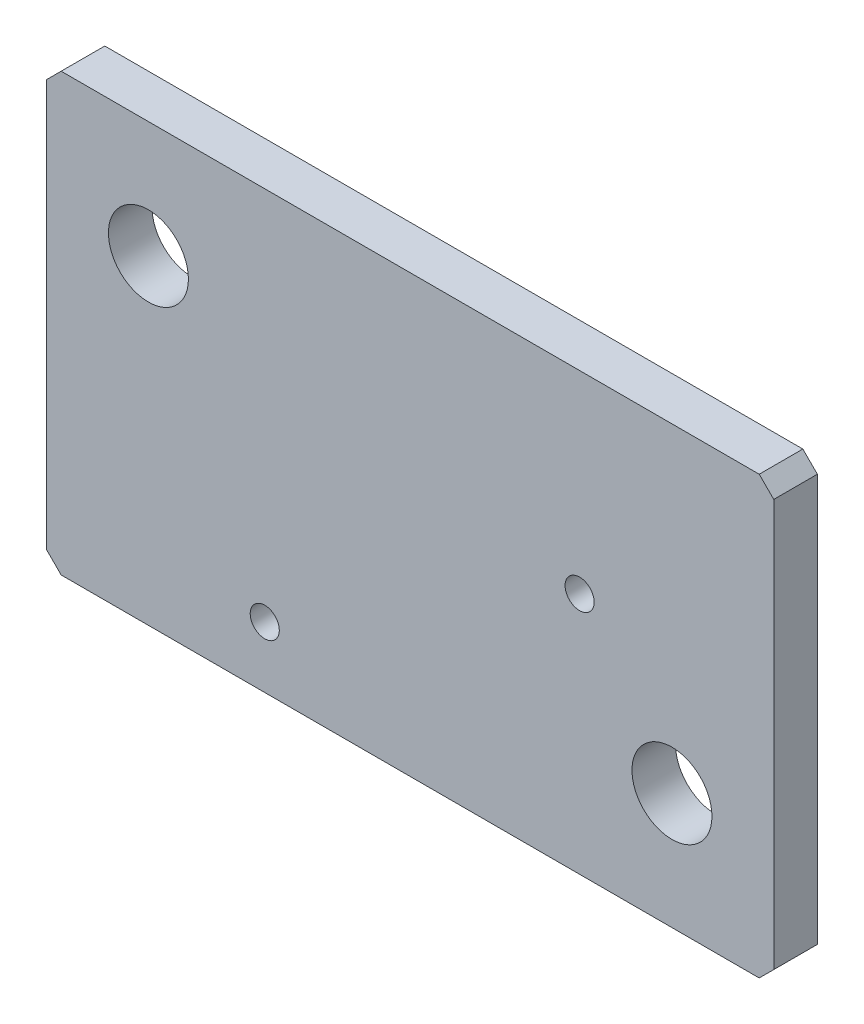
ISO-10303-21;
HEADER;
FILE_DESCRIPTION(('STEP AP214'),'2;1');
FILE_NAME('part.step','',(''),(''),'','','');
FILE_SCHEMA(('AUTOMOTIVE_DESIGN { 1 0 10303 214 1 1 1 1 }'));
ENDSEC;
DATA;
#1=APPLICATION_CONTEXT('core data for automotive mechanical design processes');
#2=APPLICATION_PROTOCOL_DEFINITION('international standard','automotive_design',2000,#1);
#3=PRODUCT_CONTEXT('',#1,'mechanical');
#4=PRODUCT('Part','Part','',(#3));
#5=PRODUCT_RELATED_PRODUCT_CATEGORY('part','',(#4));
#6=PRODUCT_DEFINITION_FORMATION('','',#4);
#7=PRODUCT_DEFINITION_CONTEXT('part definition',#1,'design');
#8=PRODUCT_DEFINITION('design','',#6,#7);
#9=PRODUCT_DEFINITION_SHAPE('','',#8);
#10=(LENGTH_UNIT() NAMED_UNIT(*) SI_UNIT(.MILLI.,.METRE.));
#11=(NAMED_UNIT(*) PLANE_ANGLE_UNIT() SI_UNIT($,.RADIAN.));
#12=(NAMED_UNIT(*) SI_UNIT($,.STERADIAN.) SOLID_ANGLE_UNIT());
#13=UNCERTAINTY_MEASURE_WITH_UNIT(LENGTH_MEASURE(1.E-05),#10,'distance_accuracy_value','');
#14=(GEOMETRIC_REPRESENTATION_CONTEXT(3) GLOBAL_UNCERTAINTY_ASSIGNED_CONTEXT((#13)) GLOBAL_UNIT_ASSIGNED_CONTEXT((#10,
#11,#12)) REPRESENTATION_CONTEXT('',''));
#15=CARTESIAN_POINT('',(0.,0.,0.));
#16=DIRECTION('',(0.,0.,1.));
#17=DIRECTION('',(1.,0.,0.));
#18=AXIS2_PLACEMENT_3D('',#15,#16,#17);
#19=CARTESIAN_POINT('',(-25.,-15.,3.));
#20=DIRECTION('',(0.,0.,1.));
#21=DIRECTION('',(1.,0.,0.));
#22=AXIS2_PLACEMENT_3D('',#19,#20,#21);
#23=PLANE('',#22);
#24=CARTESIAN_POINT('',(-9.99999999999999,-10.8,3.));
#25=DIRECTION('',(0.,0.,1.));
#26=DIRECTION('',(1.,0.,0.));
#27=AXIS2_PLACEMENT_3D('',#24,#25,#26);
#28=CIRCLE('',#27,1.);
#29=CARTESIAN_POINT('',(-8.99999999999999,-10.8,3.));
#30=VERTEX_POINT('',#29);
#31=EDGE_CURVE('E181',#30,#30,#28,.T.);
#32=ORIENTED_EDGE('',*,*,#31,.F.);
#33=EDGE_LOOP('',(#32));
#34=FACE_BOUND('',#33,.T.);
#35=CARTESIAN_POINT('',(-18.,7.,3.));
#36=DIRECTION('',(0.,0.,1.));
#37=DIRECTION('',(1.,0.,0.));
#38=AXIS2_PLACEMENT_3D('',#35,#36,#37);
#39=CIRCLE('',#38,2.75);
#40=CARTESIAN_POINT('',(-15.25,7.,3.));
#41=VERTEX_POINT('',#40);
#42=EDGE_CURVE('E167',#41,#41,#39,.T.);
#43=ORIENTED_EDGE('',*,*,#42,.F.);
#44=EDGE_LOOP('',(#43));
#45=FACE_BOUND('',#44,.T.);
#46=DIRECTION('',(0.,1.,0.));
#47=VECTOR('',#46,1.);
#48=CARTESIAN_POINT('',(25.,15.,3.));
#49=LINE('',#48,#47);
#50=CARTESIAN_POINT('',(25.,-14.,3.));
#51=VERTEX_POINT('',#50);
#52=CARTESIAN_POINT('',(25.,14.,3.));
#53=VERTEX_POINT('',#52);
#54=EDGE_CURVE('E135',#51,#53,#49,.T.);
#55=ORIENTED_EDGE('',*,*,#54,.T.);
#56=DIRECTION('',(0.707106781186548,-0.707106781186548,0.));
#57=VECTOR('',#56,1.);
#58=CARTESIAN_POINT('',(14.5,24.5,3.));
#59=LINE('',#58,#57);
#60=CARTESIAN_POINT('',(24.,15.,3.));
#61=VERTEX_POINT('',#60);
#62=EDGE_CURVE('E152',#53,#61,#59,.F.);
#63=ORIENTED_EDGE('',*,*,#62,.T.);
#64=DIRECTION('',(-1.,0.,0.));
#65=VECTOR('',#64,1.);
#66=CARTESIAN_POINT('',(-25.,15.,3.));
#67=LINE('',#66,#65);
#68=CARTESIAN_POINT('',(-24.,15.,3.));
#69=VERTEX_POINT('',#68);
#70=EDGE_CURVE('E118',#61,#69,#67,.T.);
#71=ORIENTED_EDGE('',*,*,#70,.T.);
#72=DIRECTION('',(0.707106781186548,0.707106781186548,0.));
#73=VECTOR('',#72,1.);
#74=CARTESIAN_POINT('',(-39.5,-0.5,3.));
#75=LINE('',#74,#73);
#76=CARTESIAN_POINT('',(-25.,14.,3.));
#77=VERTEX_POINT('',#76);
#78=EDGE_CURVE('E147',#69,#77,#75,.F.);
#79=ORIENTED_EDGE('',*,*,#78,.T.);
#80=DIRECTION('',(0.,-1.,0.));
#81=VECTOR('',#80,1.);
#82=CARTESIAN_POINT('',(-25.,15.,3.));
#83=LINE('',#82,#81);
#84=CARTESIAN_POINT('',(-25.,-14.,3.));
#85=VERTEX_POINT('',#84);
#86=EDGE_CURVE('E125',#77,#85,#83,.T.);
#87=ORIENTED_EDGE('',*,*,#86,.T.);
#88=DIRECTION('',(-0.707106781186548,0.707106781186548,0.));
#89=VECTOR('',#88,1.);
#90=CARTESIAN_POINT('',(-24.5,-14.5,3.));
#91=LINE('',#90,#89);
#92=CARTESIAN_POINT('',(-24.,-15.,3.));
#93=VERTEX_POINT('',#92);
#94=EDGE_CURVE('E54',#85,#93,#91,.F.);
#95=ORIENTED_EDGE('',*,*,#94,.T.);
#96=DIRECTION('',(1.,0.,0.));
#97=VECTOR('',#96,1.);
#98=CARTESIAN_POINT('',(-25.,-15.,3.));
#99=LINE('',#98,#97);
#100=CARTESIAN_POINT('',(24.,-15.,3.));
#101=VERTEX_POINT('',#100);
#102=EDGE_CURVE('E128',#93,#101,#99,.T.);
#103=ORIENTED_EDGE('',*,*,#102,.T.);
#104=DIRECTION('',(-0.707106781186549,-0.707106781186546,0.));
#105=VECTOR('',#104,1.);
#106=CARTESIAN_POINT('',(-0.50000000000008,-39.5,3.));
#107=LINE('',#106,#105);
#108=EDGE_CURVE('E150',#101,#51,#107,.F.);
#109=ORIENTED_EDGE('',*,*,#108,.T.);
#110=EDGE_LOOP('',(#55,#63,#71,#79,#87,#95,#103,#109));
#111=FACE_BOUND('',#110,.T.);
#112=CARTESIAN_POINT('',(18.,-7.,3.));
#113=DIRECTION('',(0.,0.,1.));
#114=DIRECTION('',(1.,0.,0.));
#115=AXIS2_PLACEMENT_3D('',#112,#113,#114);
#116=CIRCLE('',#115,2.75);
#117=CARTESIAN_POINT('',(20.75,-7.,3.));
#118=VERTEX_POINT('',#117);
#119=EDGE_CURVE('E175',#118,#118,#116,.T.);
#120=ORIENTED_EDGE('',*,*,#119,.F.);
#121=EDGE_LOOP('',(#120));
#122=FACE_BOUND('',#121,.T.);
#123=CARTESIAN_POINT('',(11.650635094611,1.69999999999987,3.));
#124=DIRECTION('',(0.,0.,1.));
#125=DIRECTION('',(1.,0.,0.));
#126=AXIS2_PLACEMENT_3D('',#123,#124,#125);
#127=CIRCLE('',#126,1.);
#128=CARTESIAN_POINT('',(12.650635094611,1.69999999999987,3.));
#129=VERTEX_POINT('',#128);
#130=EDGE_CURVE('E187',#129,#129,#127,.T.);
#131=ORIENTED_EDGE('',*,*,#130,.F.);
#132=EDGE_LOOP('',(#131));
#133=FACE_BOUND('',#132,.T.);
#134=ADVANCED_FACE('F32',(#34,#45,#111,#122,#133),#23,.T.);
#135=CARTESIAN_POINT('',(-25.,-15.,0.));
#136=DIRECTION('',(0.,0.,1.));
#137=DIRECTION('',(1.,0.,0.));
#138=AXIS2_PLACEMENT_3D('',#135,#136,#137);
#139=PLANE('',#138);
#140=CARTESIAN_POINT('',(-9.99999999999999,-10.8,0.));
#141=DIRECTION('',(0.,0.,1.));
#142=DIRECTION('',(1.,0.,0.));
#143=AXIS2_PLACEMENT_3D('',#140,#141,#142);
#144=CIRCLE('',#143,1.);
#145=CARTESIAN_POINT('',(-8.99999999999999,-10.8,0.));
#146=VERTEX_POINT('',#145);
#147=EDGE_CURVE('E184',#146,#146,#144,.T.);
#148=ORIENTED_EDGE('',*,*,#147,.T.);
#149=EDGE_LOOP('',(#148));
#150=FACE_BOUND('',#149,.T.);
#151=CARTESIAN_POINT('',(-18.,7.,0.));
#152=DIRECTION('',(0.,0.,1.));
#153=DIRECTION('',(1.,0.,0.));
#154=AXIS2_PLACEMENT_3D('',#151,#152,#153);
#155=CIRCLE('',#154,2.75);
#156=CARTESIAN_POINT('',(-15.25,7.,0.));
#157=VERTEX_POINT('',#156);
#158=EDGE_CURVE('E170',#157,#157,#155,.T.);
#159=ORIENTED_EDGE('',*,*,#158,.T.);
#160=EDGE_LOOP('',(#159));
#161=FACE_BOUND('',#160,.T.);
#162=DIRECTION('',(-1.,0.,0.));
#163=VECTOR('',#162,1.);
#164=CARTESIAN_POINT('',(-25.,15.,0.));
#165=LINE('',#164,#163);
#166=CARTESIAN_POINT('',(24.,15.,0.));
#167=VERTEX_POINT('',#166);
#168=CARTESIAN_POINT('',(-24.,15.,0.));
#169=VERTEX_POINT('',#168);
#170=EDGE_CURVE('E115',#167,#169,#165,.T.);
#171=ORIENTED_EDGE('',*,*,#170,.F.);
#172=DIRECTION('',(-0.707106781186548,0.707106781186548,0.));
#173=VECTOR('',#172,1.);
#174=CARTESIAN_POINT('',(24.,15.,0.));
#175=LINE('',#174,#173);
#176=CARTESIAN_POINT('',(25.,14.,0.));
#177=VERTEX_POINT('',#176);
#178=EDGE_CURVE('E98',#167,#177,#175,.F.);
#179=ORIENTED_EDGE('',*,*,#178,.T.);
#180=DIRECTION('',(0.,1.,0.));
#181=VECTOR('',#180,1.);
#182=CARTESIAN_POINT('',(25.,15.,0.));
#183=LINE('',#182,#181);
#184=CARTESIAN_POINT('',(25.,-14.,0.));
#185=VERTEX_POINT('',#184);
#186=EDGE_CURVE('E126',#185,#177,#183,.T.);
#187=ORIENTED_EDGE('',*,*,#186,.F.);
#188=DIRECTION('',(0.707106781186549,0.707106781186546,0.));
#189=VECTOR('',#188,1.);
#190=CARTESIAN_POINT('',(25.,-14.,0.));
#191=LINE('',#190,#189);
#192=CARTESIAN_POINT('',(24.,-15.,0.));
#193=VERTEX_POINT('',#192);
#194=EDGE_CURVE('E109',#185,#193,#191,.F.);
#195=ORIENTED_EDGE('',*,*,#194,.T.);
#196=DIRECTION('',(1.,0.,0.));
#197=VECTOR('',#196,1.);
#198=CARTESIAN_POINT('',(-25.,-15.,0.));
#199=LINE('',#198,#197);
#200=CARTESIAN_POINT('',(-24.,-15.,0.));
#201=VERTEX_POINT('',#200);
#202=EDGE_CURVE('E130',#201,#193,#199,.T.);
#203=ORIENTED_EDGE('',*,*,#202,.F.);
#204=DIRECTION('',(0.707106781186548,-0.707106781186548,0.));
#205=VECTOR('',#204,1.);
#206=CARTESIAN_POINT('',(-24.,-15.,0.));
#207=LINE('',#206,#205);
#208=CARTESIAN_POINT('',(-25.,-14.,0.));
#209=VERTEX_POINT('',#208);
#210=EDGE_CURVE('E141',#201,#209,#207,.F.);
#211=ORIENTED_EDGE('',*,*,#210,.T.);
#212=DIRECTION('',(0.,-1.,0.));
#213=VECTOR('',#212,1.);
#214=CARTESIAN_POINT('',(-25.,15.,0.));
#215=LINE('',#214,#213);
#216=CARTESIAN_POINT('',(-25.,14.,0.));
#217=VERTEX_POINT('',#216);
#218=EDGE_CURVE('E162',#217,#209,#215,.T.);
#219=ORIENTED_EDGE('',*,*,#218,.F.);
#220=DIRECTION('',(-0.707106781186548,-0.707106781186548,0.));
#221=VECTOR('',#220,1.);
#222=CARTESIAN_POINT('',(-25.,14.,0.));
#223=LINE('',#222,#221);
#224=EDGE_CURVE('E119',#217,#169,#223,.F.);
#225=ORIENTED_EDGE('',*,*,#224,.T.);
#226=EDGE_LOOP('',(#171,#179,#187,#195,#203,#211,#219,#225));
#227=FACE_BOUND('',#226,.T.);
#228=CARTESIAN_POINT('',(18.,-7.,0.));
#229=DIRECTION('',(0.,0.,1.));
#230=DIRECTION('',(1.,0.,0.));
#231=AXIS2_PLACEMENT_3D('',#228,#229,#230);
#232=CIRCLE('',#231,2.75);
#233=CARTESIAN_POINT('',(20.75,-7.,0.));
#234=VERTEX_POINT('',#233);
#235=EDGE_CURVE('E178',#234,#234,#232,.T.);
#236=ORIENTED_EDGE('',*,*,#235,.T.);
#237=EDGE_LOOP('',(#236));
#238=FACE_BOUND('',#237,.T.);
#239=CARTESIAN_POINT('',(11.650635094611,1.69999999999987,0.));
#240=DIRECTION('',(0.,0.,1.));
#241=DIRECTION('',(1.,0.,0.));
#242=AXIS2_PLACEMENT_3D('',#239,#240,#241);
#243=CIRCLE('',#242,1.);
#244=CARTESIAN_POINT('',(12.650635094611,1.69999999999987,0.));
#245=VERTEX_POINT('',#244);
#246=EDGE_CURVE('E190',#245,#245,#243,.T.);
#247=ORIENTED_EDGE('',*,*,#246,.T.);
#248=EDGE_LOOP('',(#247));
#249=FACE_BOUND('',#248,.T.);
#250=ADVANCED_FACE('F122',(#150,#161,#227,#238,#249),#139,.F.);
#251=CARTESIAN_POINT('',(-25.,15.,3.));
#252=DIRECTION('',(1.,0.,0.));
#253=DIRECTION('',(0.,0.,-1.));
#254=AXIS2_PLACEMENT_3D('',#251,#252,#253);
#255=PLANE('',#254);
#256=ORIENTED_EDGE('',*,*,#218,.T.);
#257=DIRECTION('',(0.,0.,1.));
#258=VECTOR('',#257,1.);
#259=CARTESIAN_POINT('',(-25.,-14.,3.));
#260=LINE('',#259,#258);
#261=EDGE_CURVE('E11',#209,#85,#260,.T.);
#262=ORIENTED_EDGE('',*,*,#261,.T.);
#263=ORIENTED_EDGE('',*,*,#86,.F.);
#264=DIRECTION('',(0.,0.,-1.));
#265=VECTOR('',#264,1.);
#266=CARTESIAN_POINT('',(-25.,14.,3.));
#267=LINE('',#266,#265);
#268=EDGE_CURVE('E40',#77,#217,#267,.T.);
#269=ORIENTED_EDGE('',*,*,#268,.T.);
#270=EDGE_LOOP('',(#256,#262,#263,#269));
#271=FACE_BOUND('',#270,.T.);
#272=ADVANCED_FACE('F34',(#271),#255,.F.);
#273=CARTESIAN_POINT('',(-25.,-15.,3.));
#274=DIRECTION('',(0.,1.,0.));
#275=DIRECTION('',(0.,0.,1.));
#276=AXIS2_PLACEMENT_3D('',#273,#274,#275);
#277=PLANE('',#276);
#278=ORIENTED_EDGE('',*,*,#202,.T.);
#279=DIRECTION('',(0.,0.,1.));
#280=VECTOR('',#279,1.);
#281=CARTESIAN_POINT('',(24.,-15.,3.));
#282=LINE('',#281,#280);
#283=EDGE_CURVE('E47',#193,#101,#282,.T.);
#284=ORIENTED_EDGE('',*,*,#283,.T.);
#285=ORIENTED_EDGE('',*,*,#102,.F.);
#286=DIRECTION('',(0.,0.,-1.));
#287=VECTOR('',#286,1.);
#288=CARTESIAN_POINT('',(-24.,-15.,3.));
#289=LINE('',#288,#287);
#290=EDGE_CURVE('E154',#93,#201,#289,.T.);
#291=ORIENTED_EDGE('',*,*,#290,.T.);
#292=EDGE_LOOP('',(#278,#284,#285,#291));
#293=FACE_BOUND('',#292,.T.);
#294=ADVANCED_FACE('F226',(#293),#277,.F.);
#295=CARTESIAN_POINT('',(25.,15.,3.));
#296=DIRECTION('',(-1.,0.,0.));
#297=DIRECTION('',(0.,-1.,0.));
#298=AXIS2_PLACEMENT_3D('',#295,#296,#297);
#299=PLANE('',#298);
#300=ORIENTED_EDGE('',*,*,#186,.T.);
#301=DIRECTION('',(0.,0.,1.));
#302=VECTOR('',#301,1.);
#303=CARTESIAN_POINT('',(25.,14.,3.));
#304=LINE('',#303,#302);
#305=EDGE_CURVE('E103',#177,#53,#304,.T.);
#306=ORIENTED_EDGE('',*,*,#305,.T.);
#307=ORIENTED_EDGE('',*,*,#54,.F.);
#308=DIRECTION('',(0.,0.,-1.));
#309=VECTOR('',#308,1.);
#310=CARTESIAN_POINT('',(25.,-14.,3.));
#311=LINE('',#310,#309);
#312=EDGE_CURVE('E108',#51,#185,#311,.T.);
#313=ORIENTED_EDGE('',*,*,#312,.T.);
#314=EDGE_LOOP('',(#300,#306,#307,#313));
#315=FACE_BOUND('',#314,.T.);
#316=ADVANCED_FACE('F224',(#315),#299,.F.);
#317=CARTESIAN_POINT('',(-25.,15.,3.));
#318=DIRECTION('',(0.,-1.,0.));
#319=DIRECTION('',(0.,0.,-1.));
#320=AXIS2_PLACEMENT_3D('',#317,#318,#319);
#321=PLANE('',#320);
#322=ORIENTED_EDGE('',*,*,#70,.F.);
#323=DIRECTION('',(0.,0.,-1.));
#324=VECTOR('',#323,1.);
#325=CARTESIAN_POINT('',(24.,15.,3.));
#326=LINE('',#325,#324);
#327=EDGE_CURVE('E102',#61,#167,#326,.T.);
#328=ORIENTED_EDGE('',*,*,#327,.T.);
#329=ORIENTED_EDGE('',*,*,#170,.T.);
#330=DIRECTION('',(0.,0.,1.));
#331=VECTOR('',#330,1.);
#332=CARTESIAN_POINT('',(-24.,15.,3.));
#333=LINE('',#332,#331);
#334=EDGE_CURVE('E120',#169,#69,#333,.T.);
#335=ORIENTED_EDGE('',*,*,#334,.T.);
#336=EDGE_LOOP('',(#322,#328,#329,#335));
#337=FACE_BOUND('',#336,.T.);
#338=ADVANCED_FACE('F114',(#337),#321,.F.);
#339=CARTESIAN_POINT('',(-18.,7.,3.));
#340=DIRECTION('',(0.,0.,-1.));
#341=DIRECTION('',(-1.,0.,0.));
#342=AXIS2_PLACEMENT_3D('',#339,#340,#341);
#343=CYLINDRICAL_SURFACE('',#342,2.75);
#344=ORIENTED_EDGE('',*,*,#42,.T.);
#345=EDGE_LOOP('',(#344));
#346=FACE_BOUND('',#345,.T.);
#347=ORIENTED_EDGE('',*,*,#158,.F.);
#348=EDGE_LOOP('',(#347));
#349=FACE_BOUND('',#348,.T.);
#350=ADVANCED_FACE('F223',(#346,#349),#343,.F.);
#351=CARTESIAN_POINT('',(18.,-7.,3.));
#352=DIRECTION('',(0.,0.,-1.));
#353=DIRECTION('',(-1.,0.,0.));
#354=AXIS2_PLACEMENT_3D('',#351,#352,#353);
#355=CYLINDRICAL_SURFACE('',#354,2.75);
#356=ORIENTED_EDGE('',*,*,#119,.T.);
#357=EDGE_LOOP('',(#356));
#358=FACE_BOUND('',#357,.T.);
#359=ORIENTED_EDGE('',*,*,#235,.F.);
#360=EDGE_LOOP('',(#359));
#361=FACE_BOUND('',#360,.T.);
#362=ADVANCED_FACE('F206',(#358,#361),#355,.F.);
#363=CARTESIAN_POINT('',(-9.99999999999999,-10.8,3.));
#364=DIRECTION('',(0.,0.,-1.));
#365=DIRECTION('',(-1.,0.,0.));
#366=AXIS2_PLACEMENT_3D('',#363,#364,#365);
#367=CYLINDRICAL_SURFACE('',#366,1.);
#368=ORIENTED_EDGE('',*,*,#31,.T.);
#369=EDGE_LOOP('',(#368));
#370=FACE_BOUND('',#369,.T.);
#371=ORIENTED_EDGE('',*,*,#147,.F.);
#372=EDGE_LOOP('',(#371));
#373=FACE_BOUND('',#372,.T.);
#374=ADVANCED_FACE('F197',(#370,#373),#367,.F.);
#375=CARTESIAN_POINT('',(11.650635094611,1.69999999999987,3.));
#376=DIRECTION('',(0.,0.,-1.));
#377=DIRECTION('',(-1.,0.,0.));
#378=AXIS2_PLACEMENT_3D('',#375,#376,#377);
#379=CYLINDRICAL_SURFACE('',#378,1.);
#380=ORIENTED_EDGE('',*,*,#130,.T.);
#381=EDGE_LOOP('',(#380));
#382=FACE_BOUND('',#381,.T.);
#383=ORIENTED_EDGE('',*,*,#246,.F.);
#384=EDGE_LOOP('',(#383));
#385=FACE_BOUND('',#384,.T.);
#386=ADVANCED_FACE('F195',(#382,#385),#379,.F.);
#387=CARTESIAN_POINT('',(24.,15.,3.));
#388=DIRECTION('',(-0.707106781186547,-0.707106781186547,0.));
#389=DIRECTION('',(0.707106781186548,-0.707106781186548,0.));
#390=AXIS2_PLACEMENT_3D('',#387,#388,#389);
#391=PLANE('',#390);
#392=ORIENTED_EDGE('',*,*,#62,.F.);
#393=ORIENTED_EDGE('',*,*,#305,.F.);
#394=ORIENTED_EDGE('',*,*,#178,.F.);
#395=ORIENTED_EDGE('',*,*,#327,.F.);
#396=EDGE_LOOP('',(#392,#393,#394,#395));
#397=FACE_BOUND('',#396,.T.);
#398=ADVANCED_FACE('F101',(#397),#391,.F.);
#399=CARTESIAN_POINT('',(25.,-14.,3.));
#400=DIRECTION('',(-0.707106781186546,0.707106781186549,0.));
#401=DIRECTION('',(-0.707106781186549,-0.707106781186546,0.));
#402=AXIS2_PLACEMENT_3D('',#399,#400,#401);
#403=PLANE('',#402);
#404=ORIENTED_EDGE('',*,*,#108,.F.);
#405=ORIENTED_EDGE('',*,*,#283,.F.);
#406=ORIENTED_EDGE('',*,*,#194,.F.);
#407=ORIENTED_EDGE('',*,*,#312,.F.);
#408=EDGE_LOOP('',(#404,#405,#406,#407));
#409=FACE_BOUND('',#408,.T.);
#410=ADVANCED_FACE('F204',(#409),#403,.F.);
#411=CARTESIAN_POINT('',(-24.,-15.,3.));
#412=DIRECTION('',(0.707106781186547,0.707106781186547,0.));
#413=DIRECTION('',(-0.707106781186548,0.707106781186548,0.));
#414=AXIS2_PLACEMENT_3D('',#411,#412,#413);
#415=PLANE('',#414);
#416=ORIENTED_EDGE('',*,*,#94,.F.);
#417=ORIENTED_EDGE('',*,*,#261,.F.);
#418=ORIENTED_EDGE('',*,*,#210,.F.);
#419=ORIENTED_EDGE('',*,*,#290,.F.);
#420=EDGE_LOOP('',(#416,#417,#418,#419));
#421=FACE_BOUND('',#420,.T.);
#422=ADVANCED_FACE('F239',(#421),#415,.F.);
#423=CARTESIAN_POINT('',(-25.,14.,3.));
#424=DIRECTION('',(0.707106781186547,-0.707106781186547,0.));
#425=DIRECTION('',(0.707106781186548,0.707106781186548,0.));
#426=AXIS2_PLACEMENT_3D('',#423,#424,#425);
#427=PLANE('',#426);
#428=ORIENTED_EDGE('',*,*,#78,.F.);
#429=ORIENTED_EDGE('',*,*,#334,.F.);
#430=ORIENTED_EDGE('',*,*,#224,.F.);
#431=ORIENTED_EDGE('',*,*,#268,.F.);
#432=EDGE_LOOP('',(#428,#429,#430,#431));
#433=FACE_BOUND('',#432,.T.);
#434=ADVANCED_FACE('F240',(#433),#427,.F.);
#435=CLOSED_SHELL('',(#134,#250,#272,#294,#316,#338,#350,#362,#374,#386,#398,#410,#422,#434));
#436=MANIFOLD_SOLID_BREP('B2',#435);
#437=ADVANCED_BREP_SHAPE_REPRESENTATION('',(#18,#436),#14);
#438=SHAPE_DEFINITION_REPRESENTATION(#9,#437);
ENDSEC;
END-ISO-10303-21;
